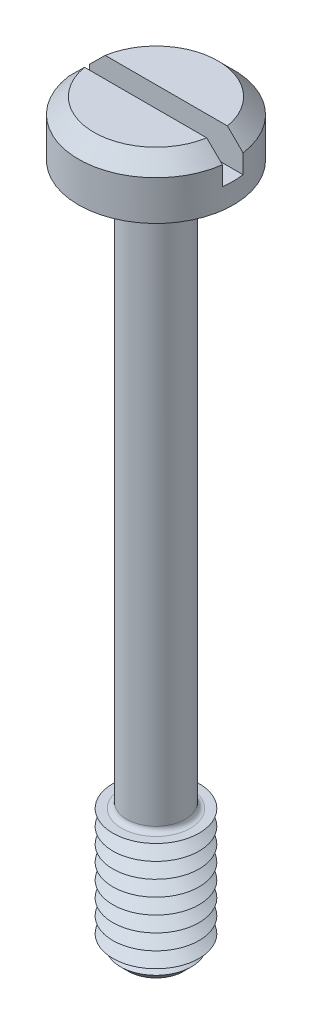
from build123d import *

# Parameters (mm, degrees)
SKETCH1_R           = 2.25
BOSS_EXTRUDE1_DEPTH = 1.6
SKETCH2_R           = 0.85
BOSS_EXTRUDE2_DEPTH = 20
SKETCH3_R           = 1.25
BOSS_EXTRUDE3_DEPTH = 3.7
CHAMFER1_SIZE       = 0.45
LPATTERN1_COUNT     = 8
LPATTERN1_PITCH     = 0.45
FILLET1_R           = 0.15
CHAMFER2_SIZE       = 0.45
SKETCH6_W           = 4.5
SKETCH6_H           = 0.6
CUT_EXTRUDE1_DEPTH  = 1


with BuildPart() as part:
    # Sketch1 → Boss-Extrude1 (new body)
    with BuildSketch(Plane(origin=(0, 0, 0), x_dir=(1, 0, 0), z_dir=(0, 1, 0))):
        with Locations(Location((0, 0, 0), (0, 0, 270))):
            Circle(SKETCH1_R)
    extrude(amount=BOSS_EXTRUDE1_DEPTH)

    # Sketch2 → Boss-Extrude2 (add)
    with BuildSketch(Plane.XZ):
        with Locations(Location((0, 0, 0), (0, 0, 270))):
            Circle(SKETCH2_R)
    extrude(amount=BOSS_EXTRUDE2_DEPTH)

    # Sketch3 → Boss-Extrude3 (add)
    with BuildSketch(Plane.XZ.offset(20)):
        with Locations(Location((0, 0, 0), (0, 0, 270))):
            Circle(SKETCH3_R)
    extrude(amount=-BOSS_EXTRUDE3_DEPTH)

    # Chamfer1
    chamfer1_edges = [part.edges().sort_by_distance(p)[0] for p in [
        (0, -20, 1.25),
    ]]
    chamfer(chamfer1_edges, length=CHAMFER1_SIZE)

    # Sketch5 → Cut-Revolve1 (revolve, cut)
    with BuildSketch(Plane(origin=(0, 0, 0), x_dir=(0, 0, -1), z_dir=(1, 0, 0))):
        Polygon((-1.25, -16.3), (-0.860288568, -16.525), (-1.25, -16.75), align=None)
    cut_revolve1 = revolve(axis=Axis((0, -6.58711856, 0), (0, -1, 0)), mode=Mode.SUBTRACT)

    # LPattern1: Cut-Revolve1 ×8
    with Locations(*[(0, -i * LPATTERN1_PITCH, 0) for i in range(1, LPATTERN1_COUNT)]):
        add(cut_revolve1, mode=Mode.SUBTRACT)

    # Fillet1
    fillet1_edges = [part.edges().sort_by_distance(p)[0] for p in [
        (0, 0, 0.85),
        (0, -16.3, 0.85),
    ]]
    fillet(fillet1_edges, radius=FILLET1_R)

    # Chamfer2
    chamfer2_edges = [part.edges().sort_by_distance(p)[0] for p in [
        (0, 1.6, -2.25),
    ]]
    chamfer(chamfer2_edges, length=CHAMFER2_SIZE)

    # Sketch6 → Cut-Extrude1 (cut)
    with BuildSketch(Plane(origin=(0, 1.6, 0), x_dir=(1, 0, 0), z_dir=(0, 1, 0))):
        Rectangle(SKETCH6_W, SKETCH6_H)
    extrude(amount=-CUT_EXTRUDE1_DEPTH, mode=Mode.SUBTRACT)


solid = part.part
